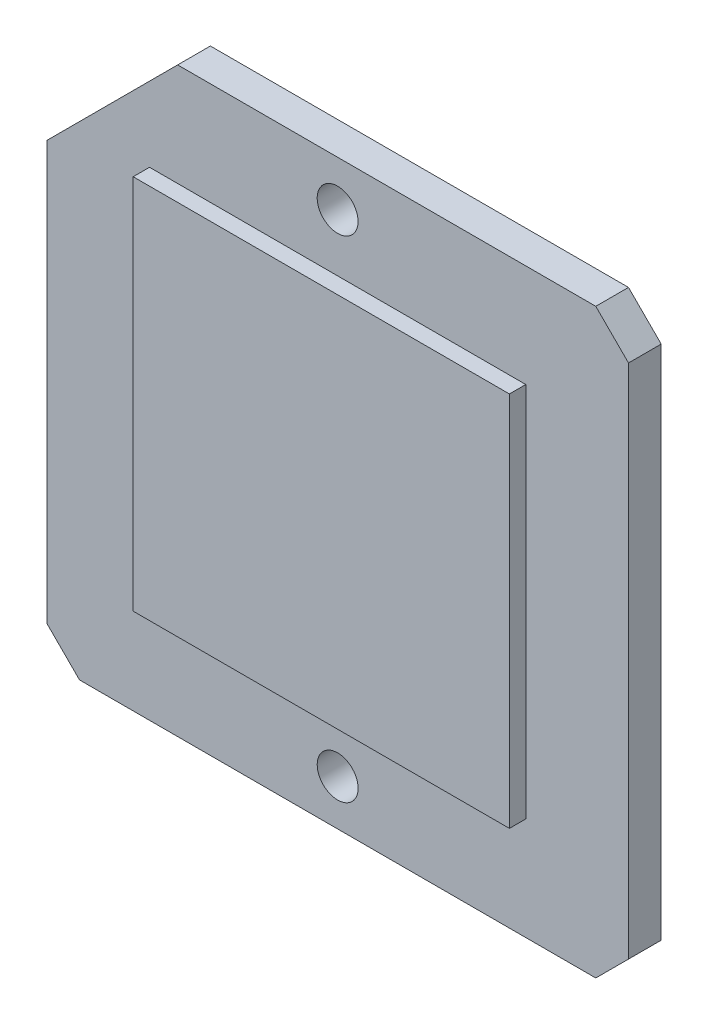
from build123d import *

# Parameters (mm, degrees)
SKETCH1_W          = 35.56
SKETCH1_H          = 35.56
EXTRUDE1_DEPTH     = 2
SKETCH2_W          = 23
SKETCH2_H          = 23
EXTRUDE2_DEPTH     = 1
CHAMFER1_SIZE      = 2
CHAMFER2_SIZE      = 8
SKETCH3_R          = 1.25
CUT_EXTRUDE1_DEPTH = 26.224131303


with BuildPart() as part:
    # Sketch1 → Extrude1 (new body)
    with BuildSketch(Plane.XY):
        Rectangle(SKETCH1_W, SKETCH1_H)
    extrude(amount=EXTRUDE1_DEPTH)

    # Sketch2 → Extrude2 (add)
    with BuildSketch(Plane.XY.offset(2)):
        Rectangle(SKETCH2_W, SKETCH2_H)
    extrude(amount=EXTRUDE2_DEPTH)

    # Chamfer1
    chamfer1_edges = [part.edges().sort_by_distance(p)[0] for p in [
        (17.78, 17.78, 1),
        (17.78, -17.78, 1),
        (-17.78, -17.78, 1),
    ]]
    chamfer(chamfer1_edges, length=CHAMFER1_SIZE)

    # Chamfer2
    chamfer2_edges = [part.edges().sort_by_distance(p)[0] for p in [
        (-17.78, 17.78, 1),
    ]]
    chamfer(chamfer2_edges, length=CHAMFER2_SIZE)

    # Sketch3 → Cut-Extrude1 (cut, through all)
    with BuildSketch(Plane.XY.offset(2)):
        with Locations((0, 15)):
            Circle(SKETCH3_R)
        with Locations(Location((0, -15, 0), (0, 0, 180))):
            Circle(SKETCH3_R)
    extrude(amount=-CUT_EXTRUDE1_DEPTH, mode=Mode.SUBTRACT)


solid = part.part
